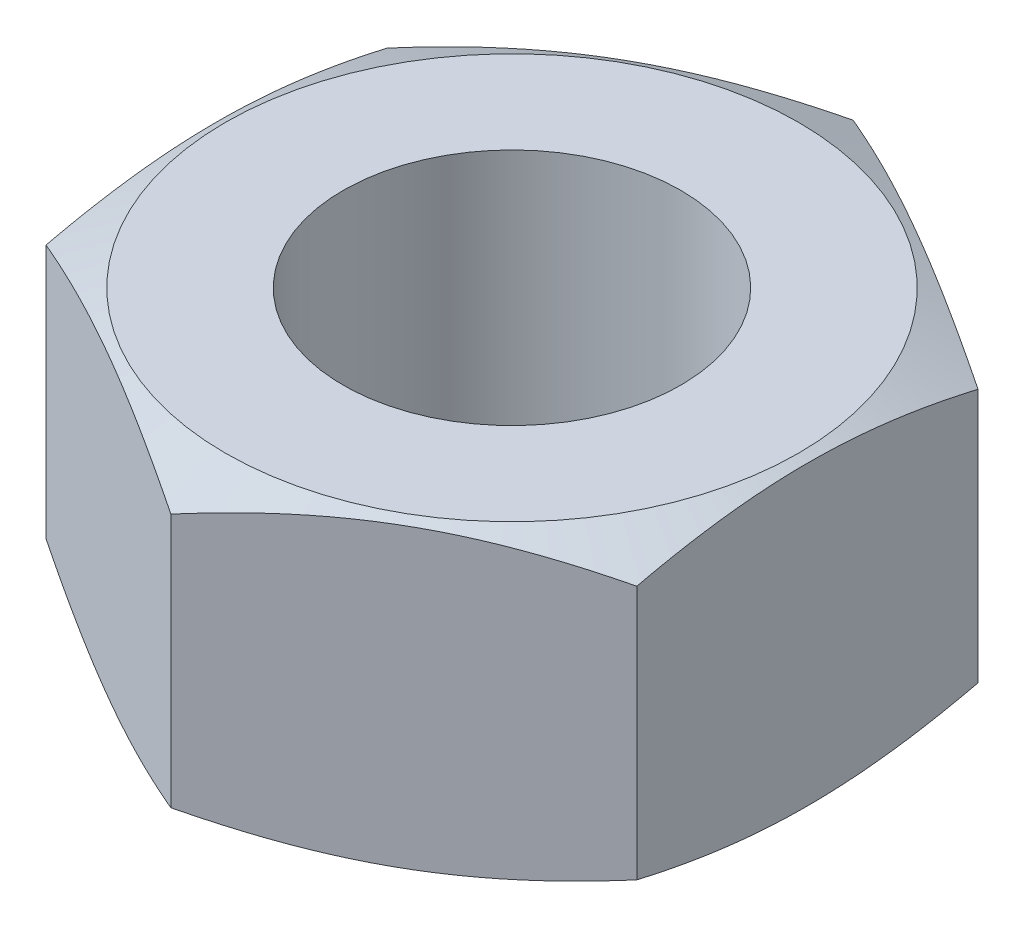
ISO-10303-21;
HEADER;
FILE_DESCRIPTION(('STEP AP214'),'2;1');
FILE_NAME('part.step','',(''),(''),'','','');
FILE_SCHEMA(('AUTOMOTIVE_DESIGN { 1 0 10303 214 1 1 1 1 }'));
ENDSEC;
DATA;
#1=APPLICATION_CONTEXT('core data for automotive mechanical design processes');
#2=APPLICATION_PROTOCOL_DEFINITION('international standard','automotive_design',2000,#1);
#3=PRODUCT_CONTEXT('',#1,'mechanical');
#4=PRODUCT('Part','Part','',(#3));
#5=PRODUCT_RELATED_PRODUCT_CATEGORY('part','',(#4));
#6=PRODUCT_DEFINITION_FORMATION('','',#4);
#7=PRODUCT_DEFINITION_CONTEXT('part definition',#1,'design');
#8=PRODUCT_DEFINITION('design','',#6,#7);
#9=PRODUCT_DEFINITION_SHAPE('','',#8);
#10=(LENGTH_UNIT() NAMED_UNIT(*) SI_UNIT(.MILLI.,.METRE.));
#11=(NAMED_UNIT(*) PLANE_ANGLE_UNIT() SI_UNIT($,.RADIAN.));
#12=(NAMED_UNIT(*) SI_UNIT($,.STERADIAN.) SOLID_ANGLE_UNIT());
#13=UNCERTAINTY_MEASURE_WITH_UNIT(LENGTH_MEASURE(1.E-05),#10,'distance_accuracy_value','');
#14=(GEOMETRIC_REPRESENTATION_CONTEXT(3) GLOBAL_UNCERTAINTY_ASSIGNED_CONTEXT((#13)) GLOBAL_UNIT_ASSIGNED_CONTEXT((#10,
#11,#12)) REPRESENTATION_CONTEXT('',''));
#15=CARTESIAN_POINT('',(0.,0.,0.));
#16=DIRECTION('',(0.,0.,1.));
#17=DIRECTION('',(1.,0.,0.));
#18=AXIS2_PLACEMENT_3D('',#15,#16,#17);
#19=CARTESIAN_POINT('',(5.38927608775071,0.,1.94289029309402E-13));
#20=DIRECTION('',(0.,-1.,0.));
#21=DIRECTION('',(0.,0.,-1.));
#22=AXIS2_PLACEMENT_3D('',#19,#20,#21);
#23=PLANE('',#22);
#24=CARTESIAN_POINT('',(1.52655665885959E-13,0.,0.));
#25=DIRECTION('',(0.,-1.,0.));
#26=DIRECTION('',(0.,0.,-1.));
#27=AXIS2_PLACEMENT_3D('',#24,#25,#26);
#28=CIRCLE('',#27,5.38927608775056);
#29=CARTESIAN_POINT('',(1.53403578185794E-13,0.,-5.38927608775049));
#30=VERTEX_POINT('',#29);
#31=EDGE_CURVE('E189',#30,#30,#28,.T.);
#32=ORIENTED_EDGE('',*,*,#31,.T.);
#33=EDGE_LOOP('',(#32));
#34=FACE_BOUND('',#33,.T.);
#35=CARTESIAN_POINT('',(1.52655665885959E-13,0.,0.));
#36=DIRECTION('',(0.,-1.,0.));
#37=DIRECTION('',(0.,0.,-1.));
#38=AXIS2_PLACEMENT_3D('',#35,#36,#37);
#39=CIRCLE('',#38,3.175);
#40=CARTESIAN_POINT('',(1.53096285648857E-13,0.,-3.17499999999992));
#41=VERTEX_POINT('',#40);
#42=EDGE_CURVE('E197',#41,#41,#39,.T.);
#43=ORIENTED_EDGE('',*,*,#42,.F.);
#44=EDGE_LOOP('',(#43));
#45=FACE_BOUND('',#44,.T.);
#46=ADVANCED_FACE('F31',(#34,#45),#23,.T.);
#47=CARTESIAN_POINT('',(0.,-57.404,0.));
#48=DIRECTION('',(0.,-1.,0.));
#49=DIRECTION('',(0.,0.,-1.));
#50=AXIS2_PLACEMENT_3D('',#47,#48,#49);
#51=CYLINDRICAL_SURFACE('',#50,3.175);
#52=ORIENTED_EDGE('',*,*,#42,.T.);
#53=EDGE_LOOP('',(#52));
#54=FACE_BOUND('',#53,.T.);
#55=CARTESIAN_POINT('',(1.38777878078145E-13,5.74039999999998,0.));
#56=DIRECTION('',(0.,-1.,0.));
#57=DIRECTION('',(0.,0.,-1.));
#58=AXIS2_PLACEMENT_3D('',#55,#56,#57);
#59=CIRCLE('',#58,3.175);
#60=CARTESIAN_POINT('',(1.39218497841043E-13,5.74039999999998,-3.17499999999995));
#61=VERTEX_POINT('',#60);
#62=EDGE_CURVE('E195',#61,#61,#59,.T.);
#63=ORIENTED_EDGE('',*,*,#62,.F.);
#64=EDGE_LOOP('',(#63));
#65=FACE_BOUND('',#64,.T.);
#66=ADVANCED_FACE('F227',(#54,#65),#51,.F.);
#67=CARTESIAN_POINT('',(3.17500000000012,5.74040000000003,1.11022302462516E-13));
#68=DIRECTION('',(0.,1.,0.));
#69=DIRECTION('',(0.,0.,1.));
#70=AXIS2_PLACEMENT_3D('',#67,#68,#69);
#71=PLANE('',#70);
#72=ORIENTED_EDGE('',*,*,#62,.T.);
#73=EDGE_LOOP('',(#72));
#74=FACE_BOUND('',#73,.T.);
#75=CARTESIAN_POINT('',(1.38777878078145E-13,5.74039999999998,0.));
#76=DIRECTION('',(0.,-1.,0.));
#77=DIRECTION('',(0.,0.,-1.));
#78=AXIS2_PLACEMENT_3D('',#75,#76,#77);
#79=CIRCLE('',#78,5.38927608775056);
#80=CARTESIAN_POINT('',(1.3952579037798E-13,5.74039999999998,-5.38927608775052));
#81=VERTEX_POINT('',#80);
#82=EDGE_CURVE('E192',#81,#81,#79,.T.);
#83=ORIENTED_EDGE('',*,*,#82,.F.);
#84=EDGE_LOOP('',(#83));
#85=FACE_BOUND('',#84,.T.);
#86=ADVANCED_FACE('F232',(#74,#85),#71,.T.);
#87=CARTESIAN_POINT('',(1.66533453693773E-13,5.26172176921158,0.));
#88=DIRECTION('',(0.,-1.,0.));
#89=DIRECTION('',(0.,0.,-1.));
#90=AXIS2_PLACEMENT_3D('',#87,#88,#89);
#91=CONICAL_SURFACE('',#90,6.41580486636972,1.13446401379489);
#92=CARTESIAN_POINT('',(5.55624999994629,3.52024736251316,-8.49463856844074));
#93=CARTESIAN_POINT('',(5.55624999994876,3.6176310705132,-8.24501883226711));
#94=CARTESIAN_POINT('',(5.55624999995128,3.71394822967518,-7.99497513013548));
#95=CARTESIAN_POINT('',(5.55624999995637,3.9038444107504,-7.49381496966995));
#96=CARTESIAN_POINT('',(5.55624999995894,3.99742308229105,-7.24269837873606));
#97=CARTESIAN_POINT('',(5.55624999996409,4.18152451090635,-6.73837536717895));
#98=CARTESIAN_POINT('',(5.55624999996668,4.27203579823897,-6.48516474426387));
#99=CARTESIAN_POINT('',(5.55624999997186,4.44880608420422,-5.97726759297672));
#100=CARTESIAN_POINT('',(5.55624999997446,4.53506523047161,-5.72258111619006));
#101=CARTESIAN_POINT('',(5.55624999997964,4.70111389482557,-5.21486442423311));
#102=CARTESIAN_POINT('',(5.55624999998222,4.78097447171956,-4.96185756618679));
#103=CARTESIAN_POINT('',(5.55624999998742,4.93411769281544,-4.45383176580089));
#104=CARTESIAN_POINT('',(5.55624999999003,5.00739999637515,-4.19881272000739));
#105=CARTESIAN_POINT('',(5.55624999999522,5.14557728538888,-3.68676419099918));
#106=CARTESIAN_POINT('',(5.55624999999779,5.21048048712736,-3.42973694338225));
#107=CARTESIAN_POINT('',(5.55625000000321,5.32986380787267,-2.91326970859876));
#108=CARTESIAN_POINT('',(5.55625000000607,5.38434538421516,-2.65383006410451));
#109=CARTESIAN_POINT('',(5.55625000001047,5.46525328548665,-2.21521628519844));
#110=CARTESIAN_POINT('',(5.55625000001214,5.49509801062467,-2.03667290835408));
#111=CARTESIAN_POINT('',(5.55625000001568,5.54804139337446,-1.67859373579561));
#112=CARTESIAN_POINT('',(5.55625000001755,5.57114065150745,-1.49905802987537));
#113=CARTESIAN_POINT('',(5.55625000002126,5.60989472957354,-1.13925767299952));
#114=CARTESIAN_POINT('',(5.55625000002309,5.62555284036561,-0.958993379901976));
#115=CARTESIAN_POINT('',(5.55625000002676,5.64891218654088,-0.597945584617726));
#116=CARTESIAN_POINT('',(5.55625000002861,5.65661348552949,-0.417162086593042));
#117=CARTESIAN_POINT('',(5.55625000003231,5.66379554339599,-0.054654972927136));
#118=CARTESIAN_POINT('',(5.55625000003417,5.66324095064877,0.127069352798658));
#119=CARTESIAN_POINT('',(5.55625000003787,5.65384581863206,0.49030300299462));
#120=CARTESIAN_POINT('',(5.55625000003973,5.64500516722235,0.67181232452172));
#121=CARTESIAN_POINT('',(5.55625000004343,5.61935596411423,1.03429451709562));
#122=CARTESIAN_POINT('',(5.55625000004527,5.60254603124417,1.21526728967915));
#123=CARTESIAN_POINT('',(5.55625000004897,5.56152364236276,1.57634958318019));
#124=CARTESIAN_POINT('',(5.55625000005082,5.53731141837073,1.75645913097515));
#125=CARTESIAN_POINT('',(5.55625000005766,5.435053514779,2.42292101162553));
#126=CARTESIAN_POINT('',(5.55625000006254,5.33577127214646,2.90607980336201));
#127=CARTESIAN_POINT('',(5.55625000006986,5.16149115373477,3.62447986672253));
#128=CARTESIAN_POINT('',(5.5562500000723,5.09912318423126,3.86304216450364));
#129=CARTESIAN_POINT('',(5.55625000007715,4.9675289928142,4.33827745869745));
#130=CARTESIAN_POINT('',(5.55625000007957,4.89830320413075,4.57495057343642));
#131=CARTESIAN_POINT('',(5.55625000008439,4.75394379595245,5.04790289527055));
#132=CARTESIAN_POINT('',(5.5562500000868,4.67877953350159,5.28417263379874));
#133=CARTESIAN_POINT('',(5.55625000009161,4.52396800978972,5.75523792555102));
#134=CARTESIAN_POINT('',(5.55625000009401,4.44432070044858,5.99003346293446));
#135=CARTESIAN_POINT('',(5.55625000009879,4.28144690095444,6.45824257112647));
#136=CARTESIAN_POINT('',(5.55625000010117,4.19822223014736,6.69165677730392));
#137=CARTESIAN_POINT('',(5.55625000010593,4.02882364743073,7.15741439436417));
#138=CARTESIAN_POINT('',(5.5562500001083,3.94264968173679,7.38975778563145));
#139=CARTESIAN_POINT('',(5.55625000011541,3.6798991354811,8.08710182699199));
#140=CARTESIAN_POINT('',(5.55625000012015,3.4996888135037,8.55073245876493));
#141=CARTESIAN_POINT('',(5.55625000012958,3.1326303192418,9.4754095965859));
#142=CARTESIAN_POINT('',(5.55625000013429,2.94578127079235,9.93645575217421));
#143=CARTESIAN_POINT('',(5.55625000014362,2.56978140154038,10.8507160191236));
#144=CARTESIAN_POINT('',(5.55625000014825,2.38069061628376,11.3039548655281));
#145=CARTESIAN_POINT('',(5.55625000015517,2.09453577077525,11.9826893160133));
#146=CARTESIAN_POINT('',(5.55625000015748,1.99874163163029,12.2087222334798));
#147=CARTESIAN_POINT('',(5.5562500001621,1.80641398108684,12.6604717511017));
#148=CARTESIAN_POINT('',(5.55625000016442,1.7098804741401,12.886188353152));
#149=CARTESIAN_POINT('',(5.55625000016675,1.613030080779,13.1117689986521));
#150=B_SPLINE_CURVE_WITH_KNOTS('',3,(#92,#93,#94,#95,#96,#97,#98,#99,#100,#101,#102,#103,#104,
#105,#106,#107,#108,#109,#110,#111,#112,#113,#114,#115,#116,#117,#118,#119,#120,#121,#122,#123,
#124,#125,#126,#127,#128,#129,#130,#131,#132,#133,#134,#135,#136,#137,#138,#139,#140,#141,#142,
#143,#144,#145,#146,#147,#148,#149),.UNSPECIFIED.,.F.,.F.,(4,2,2,2,2,2,2,2,2,2,2,2,2,2,2,2,2,2,
2,2,2,2,2,2,2,2,2,2,4),(0.,0.803838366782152,1.60777913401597,2.41445283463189,3.22109850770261,
4.01696333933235,4.81286935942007,5.60798891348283,6.40299719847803,6.94594921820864,
7.48885288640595,8.03151623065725,8.57417523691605,9.11915856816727,9.66414927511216,
10.209234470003,10.7543025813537,12.2318072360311,12.9715152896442,13.7111766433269,
14.4549412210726,15.198713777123,15.9421124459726,16.6855246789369,18.1777055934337,
19.6700841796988,21.1433688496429,21.8798505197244,22.6163277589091),.UNSPECIFIED.);
#151=CARTESIAN_POINT('',(5.55625000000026,5.26172176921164,-3.2079024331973));
#152=VERTEX_POINT('',#151);
#153=CARTESIAN_POINT('',(5.55625000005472,5.26172176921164,3.20790243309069));
#154=VERTEX_POINT('',#153);
#155=EDGE_CURVE('E181',#152,#154,#150,.T.);
#156=ORIENTED_EDGE('',*,*,#155,.F.);
#157=CARTESIAN_POINT('',(-0.000200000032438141,5.26166792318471,-6.41592033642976));
#158=CARTESIAN_POINT('',(0.167832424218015,5.30690640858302,-6.31890677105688));
#159=CARTESIAN_POINT('',(0.336484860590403,5.34923979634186,-6.22153524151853));
#160=CARTESIAN_POINT('',(0.675055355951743,5.42708797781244,-6.02606147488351));
#161=CARTESIAN_POINT('',(0.844974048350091,5.46259908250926,-5.92795887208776));
#162=CARTESIAN_POINT('',(1.18608097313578,5.52577286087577,-5.73102069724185));
#163=CARTESIAN_POINT('',(1.35727024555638,5.55342815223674,-5.63218452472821));
#164=CARTESIAN_POINT('',(1.70052644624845,5.59986946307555,-5.43400546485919));
#165=CARTESIAN_POINT('',(1.87259320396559,5.61865714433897,-5.33466267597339));
#166=CARTESIAN_POINT('',(2.21374464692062,5.6463253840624,-5.13769879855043));
#167=CARTESIAN_POINT('',(2.38281718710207,5.65540328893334,-5.04008472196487));
#168=CARTESIAN_POINT('',(2.72115728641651,5.66395507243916,-4.84474397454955));
#169=CARTESIAN_POINT('',(2.89042485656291,5.66342837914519,-4.74701729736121));
#170=CARTESIAN_POINT('',(3.22857252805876,5.65279751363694,-4.55178764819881));
#171=CARTESIAN_POINT('',(3.39745284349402,5.64270226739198,-4.45428455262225));
#172=CARTESIAN_POINT('',(3.73459638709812,5.61336894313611,-4.25963463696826));
#173=CARTESIAN_POINT('',(3.9028596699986,5.59413169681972,-4.16248778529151));
#174=CARTESIAN_POINT('',(4.19513967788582,5.55330735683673,-3.99373984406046));
#175=CARTESIAN_POINT('',(4.31935897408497,5.53361070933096,-3.92202179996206));
#176=CARTESIAN_POINT('',(4.56722968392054,5.48996361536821,-3.7789135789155));
#177=CARTESIAN_POINT('',(4.69088112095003,5.46601334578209,-3.70752338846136));
#178=CARTESIAN_POINT('',(4.93857150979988,5.41404172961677,-3.56451927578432));
#179=CARTESIAN_POINT('',(5.06260547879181,5.38598895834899,-3.49290823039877));
#180=CARTESIAN_POINT('',(5.31001754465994,5.3263662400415,-3.35006480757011));
#181=CARTESIAN_POINT('',(5.43339574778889,5.29479688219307,-3.27883236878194));
#182=CARTESIAN_POINT('',(5.55645000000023,5.26166792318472,-3.20778696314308));
#183=B_SPLINE_CURVE_WITH_KNOTS('',3,(#157,#158,#159,#160,#161,#162,#163,#164,#165,#166,#167,
#168,#169,#170,#171,#172,#173,#174,#175,#176,#177,#178,#179,#180,#181,#182),.UNSPECIFIED.,.F.,
.F.,(4,2,2,2,2,2,2,2,2,2,2,2,4),(0.,0.597727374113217,1.19577705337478,1.7943868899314,
2.39288450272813,2.97897228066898,3.56509495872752,4.15067141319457,4.73619460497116,
5.17047749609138,5.60474233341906,6.04252711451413,6.48023865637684),.UNSPECIFIED.);
#184=CARTESIAN_POINT('',(-3.25156568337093E-11,5.26172176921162,-6.41580486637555));
#185=VERTEX_POINT('',#184);
#186=EDGE_CURVE('E176',#185,#152,#183,.T.);
#187=ORIENTED_EDGE('',*,*,#186,.F.);
#188=CARTESIAN_POINT('',(-5.55645000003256,5.26166792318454,-3.20778696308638));
#189=CARTESIAN_POINT('',(-5.3884175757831,5.306906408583,-3.30480052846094));
#190=CARTESIAN_POINT('',(-5.21976513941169,5.3492397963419,-3.402172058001));
#191=CARTESIAN_POINT('',(-4.88119464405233,5.42708797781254,-3.59764582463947));
#192=CARTESIAN_POINT('',(-4.71127595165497,5.46259908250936,-3.69574842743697));
#193=CARTESIAN_POINT('',(-4.3701690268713,5.52577286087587,-3.89268660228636));
#194=CARTESIAN_POINT('',(-4.19897975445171,5.55342815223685,-3.99152277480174));
#195=CARTESIAN_POINT('',(-3.85572355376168,5.59986946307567,-4.18970183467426));
#196=CARTESIAN_POINT('',(-3.68365679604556,5.61865714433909,-4.28904462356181));
#197=CARTESIAN_POINT('',(-3.34250535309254,5.64632538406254,-4.48600850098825));
#198=CARTESIAN_POINT('',(-3.17343281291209,5.65540328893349,-4.58362257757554));
#199=CARTESIAN_POINT('',(-2.83509271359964,5.66395507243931,-4.77896332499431));
#200=CARTESIAN_POINT('',(-2.66582514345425,5.66342837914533,-4.87669000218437));
#201=CARTESIAN_POINT('',(-2.32767747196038,5.65279751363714,-5.07191965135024));
#202=CARTESIAN_POINT('',(-2.15879715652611,5.64270226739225,-5.16942274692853));
#203=CARTESIAN_POINT('',(-1.82165361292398,5.61336894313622,-5.36407266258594));
#204=CARTESIAN_POINT('',(-1.65339033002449,5.5941316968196,-5.46121951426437));
#205=CARTESIAN_POINT('',(-1.36111032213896,5.55330735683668,-5.62996745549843));
#206=CARTESIAN_POINT('',(-1.23689102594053,5.53361070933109,-5.70168549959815));
#207=CARTESIAN_POINT('',(-0.989020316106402,5.48996361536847,-5.84479372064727));
#208=CARTESIAN_POINT('',(-0.865368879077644,5.46601334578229,-5.91618391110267));
#209=CARTESIAN_POINT('',(-0.617678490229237,5.41404172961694,-6.05918802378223));
#210=CARTESIAN_POINT('',(-0.49364452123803,5.38598895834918,-6.13079906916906));
#211=CARTESIAN_POINT('',(-0.246232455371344,5.32636624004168,-6.27364249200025));
#212=CARTESIAN_POINT('',(-0.122854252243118,5.2947968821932,-6.34487493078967));
#213=CARTESIAN_POINT('',(0.000199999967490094,5.26166792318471,-6.41592033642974));
#214=B_SPLINE_CURVE_WITH_KNOTS('',3,(#188,#189,#190,#191,#192,#193,#194,#195,#196,#197,#198,
#199,#200,#201,#202,#203,#204,#205,#206,#207,#208,#209,#210,#211,#212,#213),.UNSPECIFIED.,.F.,
.F.,(4,2,2,2,2,2,2,2,2,2,2,2,4),(0.,0.597727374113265,1.19577705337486,1.79438688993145,
2.39288450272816,2.97897228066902,3.56509495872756,4.15067141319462,4.73619460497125,
5.17047749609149,5.60474233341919,6.04252711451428,6.48023865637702),.UNSPECIFIED.);
#215=CARTESIAN_POINT('',(-5.55625000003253,5.26172176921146,-3.20790243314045));
#216=VERTEX_POINT('',#215);
#217=EDGE_CURVE('E107',#216,#185,#214,.T.);
#218=ORIENTED_EDGE('',*,*,#217,.F.);
#219=CARTESIAN_POINT('',(-5.55625000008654,3.52024736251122,-8.49463856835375));
#220=CARTESIAN_POINT('',(-5.55625000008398,3.61763107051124,-8.2450188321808));
#221=CARTESIAN_POINT('',(-5.55625000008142,3.71394822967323,-7.99497513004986));
#222=CARTESIAN_POINT('',(-5.5562500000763,3.90384441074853,-7.49381496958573));
#223=CARTESIAN_POINT('',(-5.55625000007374,3.99742308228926,-7.24269837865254));
#224=CARTESIAN_POINT('',(-5.55625000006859,4.18152451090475,-6.73837536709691));
#225=CARTESIAN_POINT('',(-5.55625000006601,4.2720357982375,-6.48516474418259));
#226=CARTESIAN_POINT('',(-5.55625000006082,4.44880608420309,-5.977267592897));
#227=CARTESIAN_POINT('',(-5.55625000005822,4.53506523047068,-5.72258111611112));
#228=CARTESIAN_POINT('',(-5.55625000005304,4.70111389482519,-5.21486442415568));
#229=CARTESIAN_POINT('',(-5.55625000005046,4.78097447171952,-4.96185756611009));
#230=CARTESIAN_POINT('',(-5.55625000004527,4.93411769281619,-4.45383176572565));
#231=CARTESIAN_POINT('',(-5.55625000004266,5.00739999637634,-4.19881271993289));
#232=CARTESIAN_POINT('',(-5.55625000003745,5.14557728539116,-3.68676419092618));
#233=CARTESIAN_POINT('',(-5.55625000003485,5.21048048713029,-3.42973694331));
#234=CARTESIAN_POINT('',(-5.55625000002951,5.32986380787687,-2.91326970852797));
#235=CARTESIAN_POINT('',(-5.55625000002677,5.38434538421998,-2.65383006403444));
#236=CARTESIAN_POINT('',(-5.55625000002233,5.46525328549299,-2.21521628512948));
#237=CARTESIAN_POINT('',(-5.55625000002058,5.49509801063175,-2.0366729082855));
#238=CARTESIAN_POINT('',(-5.55625000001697,5.54804139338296,-1.67859373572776));
#239=CARTESIAN_POINT('',(-5.55625000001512,5.57114065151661,-1.49905802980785));
#240=CARTESIAN_POINT('',(-5.55625000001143,5.60989472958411,-1.13925767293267));
#241=CARTESIAN_POINT('',(-5.5562500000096,5.62555284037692,-0.958993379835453));
#242=CARTESIAN_POINT('',(-5.55625000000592,5.64891218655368,-0.59794558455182));
#243=CARTESIAN_POINT('',(-5.55625000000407,5.65661348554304,-0.417162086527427));
#244=CARTESIAN_POINT('',(-5.55625000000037,5.66379554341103,-0.0546549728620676));
#245=CARTESIAN_POINT('',(-5.55624999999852,5.66324095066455,0.12706935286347));
#246=CARTESIAN_POINT('',(-5.55624999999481,5.65384581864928,0.490303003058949));
#247=CARTESIAN_POINT('',(-5.55624999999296,5.64500516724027,0.671812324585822));
#248=CARTESIAN_POINT('',(-5.55624999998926,5.61935596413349,1.03429451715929));
#249=CARTESIAN_POINT('',(-5.55624999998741,5.60254603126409,1.21526728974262));
#250=CARTESIAN_POINT('',(-5.55624999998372,5.56152364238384,1.57634958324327));
#251=CARTESIAN_POINT('',(-5.55624999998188,5.53731141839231,1.75645913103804));
#252=CARTESIAN_POINT('',(-5.55624999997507,5.43505351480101,2.42292101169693));
#253=CARTESIAN_POINT('',(-5.55624999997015,5.33577127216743,2.90607980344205));
#254=CARTESIAN_POINT('',(-5.55624999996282,5.16149115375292,3.62447986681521));
#255=CARTESIAN_POINT('',(-5.55624999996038,5.09912318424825,3.8630421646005));
#256=CARTESIAN_POINT('',(-5.55624999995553,4.96752899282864,4.3382774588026));
#257=CARTESIAN_POINT('',(-5.55624999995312,4.8983032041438,4.57495057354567));
#258=CARTESIAN_POINT('',(-5.55624999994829,4.7539437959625,5.04790289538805));
#259=CARTESIAN_POINT('',(-5.55624999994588,4.67877953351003,5.28417263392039));
#260=CARTESIAN_POINT('',(-5.55624999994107,4.52396800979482,5.75523792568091));
#261=CARTESIAN_POINT('',(-5.55624999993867,4.44432070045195,5.99003346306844));
#262=CARTESIAN_POINT('',(-5.5562499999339,4.28144690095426,6.4582425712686));
#263=CARTESIAN_POINT('',(-5.55624999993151,4.19822223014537,6.6916567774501));
#264=CARTESIAN_POINT('',(-5.55624999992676,4.02882364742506,7.15741439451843));
#265=CARTESIAN_POINT('',(-5.55624999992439,3.94264968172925,7.38975778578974));
#266=CARTESIAN_POINT('',(-5.55624999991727,3.67989913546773,8.08710182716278));
#267=CARTESIAN_POINT('',(-5.55624999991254,3.4996888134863,8.55073245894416));
#268=CARTESIAN_POINT('',(-5.5562499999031,3.13263031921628,9.475409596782));
#269=CARTESIAN_POINT('',(-5.5562499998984,2.94578127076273,9.93645575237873));
#270=CARTESIAN_POINT('',(-5.55624999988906,2.56978140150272,10.8507160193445));
#271=CARTESIAN_POINT('',(-5.55624999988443,2.38069061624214,11.303954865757));
#272=CARTESIAN_POINT('',(-5.55624999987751,2.09453577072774,11.9826893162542));
#273=CARTESIAN_POINT('',(-5.5562499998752,1.99874163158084,12.2087222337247));
#274=CARTESIAN_POINT('',(-5.55624999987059,1.80641398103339,12.6604717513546));
#275=CARTESIAN_POINT('',(-5.55624999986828,1.70988047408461,12.8861883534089));
#276=CARTESIAN_POINT('',(-5.55624999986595,1.61303008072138,13.1117689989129));
#277=B_SPLINE_CURVE_WITH_KNOTS('',3,(#219,#220,#221,#222,#223,#224,#225,#226,#227,#228,#229,
#230,#231,#232,#233,#234,#235,#236,#237,#238,#239,#240,#241,#242,#243,#244,#245,#246,#247,#248,
#249,#250,#251,#252,#253,#254,#255,#256,#257,#258,#259,#260,#261,#262,#263,#264,#265,#266,#267,
#268,#269,#270,#271,#272,#273,#274,#275,#276),.UNSPECIFIED.,.F.,.F.,(4,2,2,2,2,2,2,2,2,2,2,2,2,
2,2,2,2,2,2,2,2,2,2,2,2,2,2,2,4),(0.,0.803838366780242,1.60777913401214,2.41445283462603,
3.22109850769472,4.01696333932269,4.81286935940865,5.6079889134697,6.4029971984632,
6.94594921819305,7.4888528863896,8.03151623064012,8.57417523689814,9.11915856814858,
9.66414927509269,10.2092344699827,10.7543025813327,12.2318072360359,12.971515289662,
13.7111766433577,14.4549412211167,15.1987137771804,15.9421124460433,16.6855246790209,
18.1777055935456,19.6700841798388,21.1433688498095,21.8798505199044,22.6163277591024),.UNSPECIFIED.);
#278=CARTESIAN_POINT('',(-5.55624999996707,5.26172176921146,3.20790243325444));
#279=VERTEX_POINT('',#278);
#280=EDGE_CURVE('E105',#279,#216,#277,.F.);
#281=ORIENTED_EDGE('',*,*,#280,.F.);
#282=CARTESIAN_POINT('',(0.000200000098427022,5.26166792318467,6.41592033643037));
#283=CARTESIAN_POINT('',(-0.167832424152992,5.30690640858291,6.31890677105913));
#284=CARTESIAN_POINT('',(-0.336484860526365,5.34923979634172,6.22153524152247));
#285=CARTESIAN_POINT('',(-0.675055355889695,5.42708797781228,6.02606147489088));
#286=CARTESIAN_POINT('',(-0.844974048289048,5.46259908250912,5.92795887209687));
#287=CARTESIAN_POINT('',(-1.18608097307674,5.52577286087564,5.73102069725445));
#288=CARTESIAN_POINT('',(-1.35727024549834,5.55342815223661,5.63218452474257));
#289=CARTESIAN_POINT('',(-1.70052644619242,5.59986946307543,5.43400546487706));
#290=CARTESIAN_POINT('',(-1.87259320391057,5.61865714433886,5.33466267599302));
#291=CARTESIAN_POINT('',(-2.2137446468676,5.6463253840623,5.13769879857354));
#292=CARTESIAN_POINT('',(-2.38281718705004,5.65540328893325,5.0400847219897));
#293=CARTESIAN_POINT('',(-2.72115728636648,5.66395507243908,4.84474397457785));
#294=CARTESIAN_POINT('',(-2.89042485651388,5.6634283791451,4.74701729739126));
#295=CARTESIAN_POINT('',(-3.2285725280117,5.65279751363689,4.55178764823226));
#296=CARTESIAN_POINT('',(-3.39745284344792,5.64270226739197,4.45428455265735));
#297=CARTESIAN_POINT('',(-3.73459638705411,5.61336894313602,4.25963463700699));
#298=CARTESIAN_POINT('',(-3.90285966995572,5.59413169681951,4.16248778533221));
#299=CARTESIAN_POINT('',(-4.19513967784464,5.55330735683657,3.99373984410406));
#300=CARTESIAN_POINT('',(-4.31935897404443,5.5336107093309,3.92202180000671));
#301=CARTESIAN_POINT('',(-4.56722968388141,5.48996361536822,3.77891357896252));
#302=CARTESIAN_POINT('',(-4.69088112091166,5.46601334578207,3.70752338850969));
#303=CARTESIAN_POINT('',(-4.93857150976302,5.41404172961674,3.5645192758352));
#304=CARTESIAN_POINT('',(-5.06260547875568,5.38598895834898,3.49290823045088));
#305=CARTESIAN_POINT('',(-5.31001754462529,5.32636624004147,3.35006480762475));
#306=CARTESIAN_POINT('',(-5.433395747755,5.294796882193,3.27883236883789));
#307=CARTESIAN_POINT('',(-5.55644999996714,5.26166792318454,3.20778696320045));
#308=B_SPLINE_CURVE_WITH_KNOTS('',3,(#282,#283,#284,#285,#286,#287,#288,#289,#290,#291,#292,
#293,#294,#295,#296,#297,#298,#299,#300,#301,#302,#303,#304,#305,#306,#307),.UNSPECIFIED.,.F.,
.F.,(4,2,2,2,2,2,2,2,2,2,2,2,4),(0.,0.597727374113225,1.19577705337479,1.79438688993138,
2.3928845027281,2.97897228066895,3.56509495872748,4.15067141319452,4.73619460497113,
5.17047749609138,5.6047423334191,6.04252711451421,6.48023865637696),.UNSPECIFIED.);
#309=CARTESIAN_POINT('',(9.8504537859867E-11,5.26172176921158,6.41580486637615));
#310=VERTEX_POINT('',#309);
#311=EDGE_CURVE('E89',#310,#279,#308,.T.);
#312=ORIENTED_EDGE('',*,*,#311,.F.);
#313=CARTESIAN_POINT('',(5.55645000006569,5.26166792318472,3.20778696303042));
#314=CARTESIAN_POINT('',(5.38841757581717,5.30690640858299,3.30480052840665));
#315=CARTESIAN_POINT('',(5.21976513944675,5.3492397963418,3.4021720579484));
#316=CARTESIAN_POINT('',(4.88119464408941,5.42708797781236,3.5976458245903));
#317=CARTESIAN_POINT('',(4.71127595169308,5.4625990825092,3.69574842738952));
#318=CARTESIAN_POINT('',(4.37016902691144,5.5257728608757,3.89268660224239));
#319=CARTESIAN_POINT('',(4.19897975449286,5.55342815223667,3.99152277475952));
#320=CARTESIAN_POINT('',(3.85572355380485,5.59986946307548,4.18970183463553));
#321=CARTESIAN_POINT('',(3.68365679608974,5.61865714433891,4.28904462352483));
#322=CARTESIAN_POINT('',(3.34250535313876,5.64632538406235,4.48600850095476));
#323=CARTESIAN_POINT('',(3.17343281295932,5.65540328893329,4.58362257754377));
#324=CARTESIAN_POINT('',(2.83509271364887,5.66395507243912,4.77896332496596));
#325=CARTESIAN_POINT('',(2.66582514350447,5.66342837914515,4.87669000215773));
#326=CARTESIAN_POINT('',(2.32767747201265,5.65279751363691,5.07191965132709));
#327=CARTESIAN_POINT('',(2.15879715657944,5.64270226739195,5.16942274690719));
#328=CARTESIAN_POINT('',(1.82165361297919,5.6133689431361,5.36407266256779));
#329=CARTESIAN_POINT('',(1.65339033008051,5.59413169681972,5.46121951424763));
#330=CARTESIAN_POINT('',(1.36111032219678,5.55330735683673,5.62996745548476));
#331=CARTESIAN_POINT('',(1.23689102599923,5.53361070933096,5.70168549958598));
#332=CARTESIAN_POINT('',(0.989020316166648,5.4899636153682,5.84479372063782));
#333=CARTESIAN_POINT('',(0.865368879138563,5.46601334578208,5.91618391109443));
#334=CARTESIAN_POINT('',(0.617678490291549,5.41404172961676,6.05918802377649));
#335=CARTESIAN_POINT('',(0.493644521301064,5.38598895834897,6.13079906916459));
#336=CARTESIAN_POINT('',(0.246232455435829,5.32636624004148,6.27364249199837));
#337=CARTESIAN_POINT('',(0.12285425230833,5.29479688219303,6.34487493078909));
#338=CARTESIAN_POINT('',(-0.000199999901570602,5.26166792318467,6.41592033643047));
#339=B_SPLINE_CURVE_WITH_KNOTS('',3,(#313,#314,#315,#316,#317,#318,#319,#320,#321,#322,#323,
#324,#325,#326,#327,#328,#329,#330,#331,#332,#333,#334,#335,#336,#337,#338),.UNSPECIFIED.,.F.,
.F.,(4,2,2,2,2,2,2,2,2,2,2,2,4),(0.,0.59772737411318,1.19577705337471,1.79438688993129,
2.392884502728,2.97897228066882,3.56509495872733,4.15067141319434,4.7361946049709,
5.17047749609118,5.60474233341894,6.04252711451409,6.48023865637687),.UNSPECIFIED.);
#340=EDGE_CURVE('E84',#154,#310,#339,.T.);
#341=ORIENTED_EDGE('',*,*,#340,.F.);
#342=EDGE_LOOP('',(#156,#187,#218,#281,#312,#341));
#343=FACE_BOUND('',#342,.T.);
#344=ORIENTED_EDGE('',*,*,#82,.T.);
#345=EDGE_LOOP('',(#344));
#346=FACE_BOUND('',#345,.T.);
#347=ADVANCED_FACE('F102',(#343,#346),#91,.T.);
#348=CARTESIAN_POINT('',(1.52655665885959E-13,0.,0.));
#349=DIRECTION('',(0.,1.,0.));
#350=DIRECTION('',(0.,0.,1.));
#351=AXIS2_PLACEMENT_3D('',#348,#349,#350);
#352=CONICAL_SURFACE('',#351,5.38927608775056,1.1344640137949);
#353=CARTESIAN_POINT('',(5.55624999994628,2.22015263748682,-8.49463856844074));
#354=CARTESIAN_POINT('',(5.55624999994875,2.12276892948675,-8.24501883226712));
#355=CARTESIAN_POINT('',(5.55624999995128,2.02645177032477,-7.99497513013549));
#356=CARTESIAN_POINT('',(5.55624999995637,1.83655558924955,-7.49381496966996));
#357=CARTESIAN_POINT('',(5.55624999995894,1.74297691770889,-7.24269837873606));
#358=CARTESIAN_POINT('',(5.55624999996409,1.5588754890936,-6.73837536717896));
#359=CARTESIAN_POINT('',(5.55624999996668,1.46836420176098,-6.48516474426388));
#360=CARTESIAN_POINT('',(5.55624999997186,1.29159391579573,-5.97726759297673));
#361=CARTESIAN_POINT('',(5.55624999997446,1.20533476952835,-5.72258111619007));
#362=CARTESIAN_POINT('',(5.55624999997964,1.03928610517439,-5.21486442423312));
#363=CARTESIAN_POINT('',(5.55624999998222,0.959425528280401,-4.96185756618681));
#364=CARTESIAN_POINT('',(5.55624999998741,0.806282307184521,-4.45383176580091));
#365=CARTESIAN_POINT('',(5.55624999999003,0.733000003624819,-4.1988127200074));
#366=CARTESIAN_POINT('',(5.55624999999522,0.594822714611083,-3.6867641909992));
#367=CARTESIAN_POINT('',(5.55624999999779,0.529919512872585,-3.42973694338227));
#368=CARTESIAN_POINT('',(5.5562500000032,0.410536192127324,-2.91326970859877));
#369=CARTESIAN_POINT('',(5.55625000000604,0.356054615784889,-2.65383006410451));
#370=CARTESIAN_POINT('',(5.55625000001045,0.275146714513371,-2.21521628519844));
#371=CARTESIAN_POINT('',(5.55625000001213,0.245301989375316,-2.03667290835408));
#372=CARTESIAN_POINT('',(5.55625000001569,0.192358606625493,-1.67859373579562));
#373=CARTESIAN_POINT('',(5.55625000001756,0.169259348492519,-1.49905802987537));
#374=CARTESIAN_POINT('',(5.55625000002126,0.130505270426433,-1.13925767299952));
#375=CARTESIAN_POINT('',(5.55625000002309,0.11484715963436,-0.95899337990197));
#376=CARTESIAN_POINT('',(5.55625000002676,0.091487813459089,-0.597945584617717));
#377=CARTESIAN_POINT('',(5.55625000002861,0.0837865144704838,-0.417162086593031));
#378=CARTESIAN_POINT('',(5.55625000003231,0.076604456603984,-0.054654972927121));
#379=CARTESIAN_POINT('',(5.55625000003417,0.0771590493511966,0.127069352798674));
#380=CARTESIAN_POINT('',(5.55625000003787,0.0865541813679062,0.490303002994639));
#381=CARTESIAN_POINT('',(5.55625000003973,0.0953948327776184,0.67181232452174));
#382=CARTESIAN_POINT('',(5.55625000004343,0.121044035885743,1.03429451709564));
#383=CARTESIAN_POINT('',(5.55625000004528,0.137853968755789,1.21526728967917));
#384=CARTESIAN_POINT('',(5.55625000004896,0.17887635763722,1.57634958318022));
#385=CARTESIAN_POINT('',(5.55625000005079,0.203088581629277,1.75645913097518));
#386=CARTESIAN_POINT('',(5.55625000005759,0.305346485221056,2.42292101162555));
#387=CARTESIAN_POINT('',(5.55625000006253,0.404628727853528,2.90607980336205));
#388=CARTESIAN_POINT('',(5.55625000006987,0.578908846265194,3.62447986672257));
#389=CARTESIAN_POINT('',(5.5562500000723,0.641276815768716,3.86304216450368));
#390=CARTESIAN_POINT('',(5.55625000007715,0.772871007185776,4.3382774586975));
#391=CARTESIAN_POINT('',(5.55625000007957,0.84209679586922,4.57495057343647));
#392=CARTESIAN_POINT('',(5.55625000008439,0.986456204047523,5.0479028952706));
#393=CARTESIAN_POINT('',(5.5562500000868,1.06162046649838,5.28417263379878));
#394=CARTESIAN_POINT('',(5.55625000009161,1.21643199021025,5.75523792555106));
#395=CARTESIAN_POINT('',(5.55625000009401,1.29607929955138,5.9900334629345));
#396=CARTESIAN_POINT('',(5.55625000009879,1.45895309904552,6.45824257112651));
#397=CARTESIAN_POINT('',(5.55625000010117,1.5421777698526,6.69165677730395));
#398=CARTESIAN_POINT('',(5.55625000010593,1.71157635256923,7.15741439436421));
#399=CARTESIAN_POINT('',(5.5562500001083,1.79775031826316,7.38975778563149));
#400=CARTESIAN_POINT('',(5.55625000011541,2.06050086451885,8.08710182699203));
#401=CARTESIAN_POINT('',(5.55625000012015,2.24071118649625,8.55073245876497));
#402=CARTESIAN_POINT('',(5.55625000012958,2.60776968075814,9.47540959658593));
#403=CARTESIAN_POINT('',(5.55625000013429,2.7946187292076,9.93645575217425));
#404=CARTESIAN_POINT('',(5.55625000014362,3.17061859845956,10.8507160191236));
#405=CARTESIAN_POINT('',(5.55625000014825,3.35970938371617,11.3039548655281));
#406=CARTESIAN_POINT('',(5.55625000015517,3.64586422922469,11.9826893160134));
#407=CARTESIAN_POINT('',(5.55625000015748,3.74165836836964,12.2087222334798));
#408=CARTESIAN_POINT('',(5.5562500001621,3.93398601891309,12.6604717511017));
#409=CARTESIAN_POINT('',(5.55625000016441,4.03051952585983,12.8861883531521));
#410=CARTESIAN_POINT('',(5.55625000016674,4.12736991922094,13.1117689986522));
#411=B_SPLINE_CURVE_WITH_KNOTS('',3,(#353,#354,#355,#356,#357,#358,#359,#360,#361,#362,#363,
#364,#365,#366,#367,#368,#369,#370,#371,#372,#373,#374,#375,#376,#377,#378,#379,#380,#381,#382,
#383,#384,#385,#386,#387,#388,#389,#390,#391,#392,#393,#394,#395,#396,#397,#398,#399,#400,#401,
#402,#403,#404,#405,#406,#407,#408,#409,#410),.UNSPECIFIED.,.F.,.F.,(4,2,2,2,2,2,2,2,2,2,2,2,2,
2,2,2,2,2,2,2,2,2,2,2,2,2,2,2,4),(0.,0.803838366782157,1.60777913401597,2.41445283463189,
3.22109850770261,4.01696333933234,4.81286935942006,5.60798891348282,6.40299719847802,
6.94594921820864,7.48885288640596,8.03151623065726,8.57417523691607,9.11915856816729,
9.66414927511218,10.209234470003,10.7543025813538,12.2318072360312,12.9715152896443,
13.7111766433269,14.4549412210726,15.198713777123,15.9421124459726,16.6855246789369,
18.1777055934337,19.6700841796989,21.1433688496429,21.8798505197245,22.6163277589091),.UNSPECIFIED.);
#412=CARTESIAN_POINT('',(5.55625000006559,0.478678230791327,3.20790243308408));
#413=VERTEX_POINT('',#412);
#414=CARTESIAN_POINT('',(5.55625000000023,0.478678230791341,-3.20790243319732));
#415=VERTEX_POINT('',#414);
#416=EDGE_CURVE('E11',#413,#415,#411,.F.);
#417=ORIENTED_EDGE('',*,*,#416,.F.);
#418=CARTESIAN_POINT('',(-0.000199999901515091,0.478732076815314,6.41592033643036));
#419=CARTESIAN_POINT('',(0.167832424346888,0.433493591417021,6.3189067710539));
#420=CARTESIAN_POINT('',(0.336484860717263,0.39116020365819,6.22153524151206));
#421=CARTESIAN_POINT('',(0.675055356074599,0.313312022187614,6.02606147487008));
#422=CARTESIAN_POINT('',(0.844974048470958,0.277800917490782,5.92795887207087));
#423=CARTESIAN_POINT('',(1.18608097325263,0.214627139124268,5.731020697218));
#424=CARTESIAN_POINT('',(1.35727024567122,0.186971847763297,5.63218452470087));
#425=CARTESIAN_POINT('',(1.70052644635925,0.140530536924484,5.43400546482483));
#426=CARTESIAN_POINT('',(1.87259320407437,0.121742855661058,5.33466267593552));
#427=CARTESIAN_POINT('',(2.21374464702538,0.0940746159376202,5.13769879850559));
#428=CARTESIAN_POINT('',(2.38281718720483,0.0849967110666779,5.04008472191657));
#429=CARTESIAN_POINT('',(2.7211572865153,0.0764449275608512,4.84474397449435));
#430=CARTESIAN_POINT('',(2.89042485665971,0.0769716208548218,4.74701729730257));
#431=CARTESIAN_POINT('',(3.22857252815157,0.0876024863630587,4.55178764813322));
#432=CARTESIAN_POINT('',(3.39745284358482,0.0976977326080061,4.45428455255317));
#433=CARTESIAN_POINT('',(3.73459638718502,0.127031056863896,4.25963463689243));
#434=CARTESIAN_POINT('',(3.90285967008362,0.146268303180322,4.16248778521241));
#435=CARTESIAN_POINT('',(4.19513967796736,0.187092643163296,3.99373984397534));
#436=CARTESIAN_POINT('',(4.31935897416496,0.206789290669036,3.92202179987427));
#437=CARTESIAN_POINT('',(4.56722968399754,0.250436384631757,3.77891357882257));
#438=CARTESIAN_POINT('',(4.69088112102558,0.274386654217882,3.70752338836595));
#439=CARTESIAN_POINT('',(4.9385715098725,0.326358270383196,3.56451927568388));
#440=CARTESIAN_POINT('',(5.06260547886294,0.354411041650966,3.49290823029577));
#441=CARTESIAN_POINT('',(5.31001754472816,0.414033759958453,3.35006480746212));
#442=CARTESIAN_POINT('',(5.43339574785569,0.445603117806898,3.27883236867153));
#443=CARTESIAN_POINT('',(5.5564500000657,0.4787320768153,3.20778696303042));
#444=B_SPLINE_CURVE_WITH_KNOTS('',3,(#418,#419,#420,#421,#422,#423,#424,#425,#426,#427,#428,
#429,#430,#431,#432,#433,#434,#435,#436,#437,#438,#439,#440,#441,#442,#443),.UNSPECIFIED.,.F.,
.F.,(4,2,2,2,2,2,2,2,2,2,2,2,4),(0.,0.597727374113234,1.19577705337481,1.79438688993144,
2.39288450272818,2.97897228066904,3.5650949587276,4.15067141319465,4.73619460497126,
5.17047749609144,5.60474233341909,6.04252711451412,6.48023865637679),.UNSPECIFIED.);
#445=CARTESIAN_POINT('',(1.09398601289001E-10,0.478678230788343,6.41580486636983));
#446=VERTEX_POINT('',#445);
#447=EDGE_CURVE('E140',#446,#413,#444,.T.);
#448=ORIENTED_EDGE('',*,*,#447,.F.);
#449=CARTESIAN_POINT('',(-5.5564499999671,0.478732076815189,3.20778696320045));
#450=CARTESIAN_POINT('',(-5.38841757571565,0.43349359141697,3.30480052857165));
#451=CARTESIAN_POINT('',(-5.21976513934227,0.391160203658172,3.40217205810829));
#452=CARTESIAN_POINT('',(-4.88119464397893,0.313312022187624,3.59764582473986));
#453=CARTESIAN_POINT('',(-4.71127595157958,0.277800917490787,3.69574842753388));
#454=CARTESIAN_POINT('',(-4.37016902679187,0.214627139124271,3.89268660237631));
#455=CARTESIAN_POINT('',(-4.19897975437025,0.186971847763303,3.99152277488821));
#456=CARTESIAN_POINT('',(-3.85572355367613,0.140530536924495,4.18970183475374));
#457=CARTESIAN_POINT('',(-3.68365679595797,0.12174285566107,4.28904462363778));
#458=CARTESIAN_POINT('',(-3.34250535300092,0.0940746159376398,4.48600850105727));
#459=CARTESIAN_POINT('',(-3.17343281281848,0.0849967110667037,4.58362257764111));
#460=CARTESIAN_POINT('',(-2.83509271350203,0.0764449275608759,4.77896332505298));
#461=CARTESIAN_POINT('',(-2.66582514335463,0.0769716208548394,4.87669000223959));
#462=CARTESIAN_POINT('',(-2.32767747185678,0.0876024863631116,5.07191965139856));
#463=CARTESIAN_POINT('',(-2.15879715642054,0.0976977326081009,5.16942274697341));
#464=CARTESIAN_POINT('',(-1.82165361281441,0.127031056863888,5.36407266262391));
#465=CARTESIAN_POINT('',(-1.65339032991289,0.14626830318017,5.46121951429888));
#466=CARTESIAN_POINT('',(-1.36111032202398,0.187092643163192,5.62996745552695));
#467=CARTESIAN_POINT('',(-1.23689102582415,0.206789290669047,5.70168549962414));
#468=CARTESIAN_POINT('',(-0.989020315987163,0.250436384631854,5.84479372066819));
#469=CARTESIAN_POINT('',(-0.865368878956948,0.27438665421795,5.91618391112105));
#470=CARTESIAN_POINT('',(-0.617678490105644,0.326358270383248,6.05918802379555));
#471=CARTESIAN_POINT('',(-0.493644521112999,0.35441104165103,6.13079906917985));
#472=CARTESIAN_POINT('',(-0.246232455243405,0.414033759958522,6.27364249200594));
#473=CARTESIAN_POINT('',(-0.122854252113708,0.44560311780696,6.34487493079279));
#474=CARTESIAN_POINT('',(0.000200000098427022,0.478732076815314,6.41592033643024));
#475=B_SPLINE_CURVE_WITH_KNOTS('',3,(#449,#450,#451,#452,#453,#454,#455,#456,#457,#458,#459,
#460,#461,#462,#463,#464,#465,#466,#467,#468,#469,#470,#471,#472,#473,#474),.UNSPECIFIED.,.F.,
.F.,(4,2,2,2,2,2,2,2,2,2,2,2,4),(0.,0.597727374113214,1.19577705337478,1.79438688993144,
2.3928845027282,2.97897228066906,3.56509495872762,4.15067141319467,4.73619460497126,
5.17047749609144,5.60474233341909,6.04252711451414,6.48023865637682),.UNSPECIFIED.);
#476=CARTESIAN_POINT('',(-5.55624999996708,0.47867823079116,3.20790243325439));
#477=VERTEX_POINT('',#476);
#478=EDGE_CURVE('E97',#477,#446,#475,.T.);
#479=ORIENTED_EDGE('',*,*,#478,.F.);
#480=CARTESIAN_POINT('',(-5.55625000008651,2.2201526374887,-8.49463856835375));
#481=CARTESIAN_POINT('',(-5.55625000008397,2.12276892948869,-8.2450188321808));
#482=CARTESIAN_POINT('',(-5.55625000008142,2.0264517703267,-7.99497513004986));
#483=CARTESIAN_POINT('',(-5.5562500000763,1.8365555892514,-7.49381496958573));
#484=CARTESIAN_POINT('',(-5.55625000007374,1.74297691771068,-7.24269837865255));
#485=CARTESIAN_POINT('',(-5.55625000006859,1.55887548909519,-6.73837536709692));
#486=CARTESIAN_POINT('',(-5.55625000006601,1.46836420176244,-6.4851647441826));
#487=CARTESIAN_POINT('',(-5.55625000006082,1.29159391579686,-5.977267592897));
#488=CARTESIAN_POINT('',(-5.55625000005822,1.20533476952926,-5.72258111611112));
#489=CARTESIAN_POINT('',(-5.55625000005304,1.03928610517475,-5.21486442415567));
#490=CARTESIAN_POINT('',(-5.55625000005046,0.959425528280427,-4.96185756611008));
#491=CARTESIAN_POINT('',(-5.55625000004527,0.806282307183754,-4.45383176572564));
#492=CARTESIAN_POINT('',(-5.55625000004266,0.733000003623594,-4.19881271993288));
#493=CARTESIAN_POINT('',(-5.55625000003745,0.594822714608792,-3.68676419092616));
#494=CARTESIAN_POINT('',(-5.55625000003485,0.529919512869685,-3.42973694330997));
#495=CARTESIAN_POINT('',(-5.55625000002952,0.410536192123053,-2.91326970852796));
#496=CARTESIAN_POINT('',(-5.55625000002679,0.356054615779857,-2.65383006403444));
#497=CARTESIAN_POINT('',(-5.55625000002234,0.275146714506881,-2.21521628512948));
#498=CARTESIAN_POINT('',(-5.55625000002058,0.245301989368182,-2.03667290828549));
#499=CARTESIAN_POINT('',(-5.55625000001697,0.192358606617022,-1.67859373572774));
#500=CARTESIAN_POINT('',(-5.55625000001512,0.169259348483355,-1.49905802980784));
#501=CARTESIAN_POINT('',(-5.55625000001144,0.13050527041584,-1.13925767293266));
#502=CARTESIAN_POINT('',(-5.5562500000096,0.114847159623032,-0.958993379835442));
#503=CARTESIAN_POINT('',(-5.55625000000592,0.091487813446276,-0.597945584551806));
#504=CARTESIAN_POINT('',(-5.55625000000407,0.0837865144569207,-0.417162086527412));
#505=CARTESIAN_POINT('',(-5.55625000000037,0.0766044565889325,-0.0546549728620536));
#506=CARTESIAN_POINT('',(-5.55624999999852,0.0771590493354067,0.127069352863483));
#507=CARTESIAN_POINT('',(-5.55624999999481,0.0865541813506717,0.490303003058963));
#508=CARTESIAN_POINT('',(-5.55624999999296,0.0953948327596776,0.671812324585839));
#509=CARTESIAN_POINT('',(-5.55624999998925,0.121044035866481,1.03429451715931));
#510=CARTESIAN_POINT('',(-5.5562499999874,0.137853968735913,1.21526728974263));
#511=CARTESIAN_POINT('',(-5.55624999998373,0.178876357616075,1.57634958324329));
#512=CARTESIAN_POINT('',(-5.55624999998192,0.203088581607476,1.75645913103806));
#513=CARTESIAN_POINT('',(-5.55624999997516,0.305346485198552,2.42292101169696));
#514=CARTESIAN_POINT('',(-5.55624999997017,0.404628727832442,2.90607980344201));
#515=CARTESIAN_POINT('',(-5.55624999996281,0.578908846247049,3.62447986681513));
#516=CARTESIAN_POINT('',(-5.55624999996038,0.641276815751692,3.86304216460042));
#517=CARTESIAN_POINT('',(-5.55624999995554,0.772871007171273,4.33827745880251));
#518=CARTESIAN_POINT('',(-5.55624999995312,0.842096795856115,4.57495057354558));
#519=CARTESIAN_POINT('',(-5.55624999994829,0.986456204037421,5.04790289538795));
#520=CARTESIAN_POINT('',(-5.55624999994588,1.06162046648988,5.28417263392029));
#521=CARTESIAN_POINT('',(-5.55624999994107,1.21643199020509,5.75523792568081));
#522=CARTESIAN_POINT('',(-5.55624999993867,1.29607929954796,5.99003346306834));
#523=CARTESIAN_POINT('',(-5.5562499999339,1.45895309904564,6.45824257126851));
#524=CARTESIAN_POINT('',(-5.55624999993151,1.54217776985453,6.69165677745));
#525=CARTESIAN_POINT('',(-5.55624999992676,1.71157635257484,7.15741439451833));
#526=CARTESIAN_POINT('',(-5.55624999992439,1.79775031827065,7.38975778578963));
#527=CARTESIAN_POINT('',(-5.55624999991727,2.06050086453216,8.08710182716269));
#528=CARTESIAN_POINT('',(-5.55624999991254,2.2407111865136,8.55073245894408));
#529=CARTESIAN_POINT('',(-5.5562499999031,2.60776968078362,9.47540959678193));
#530=CARTESIAN_POINT('',(-5.55624999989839,2.79461872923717,9.93645575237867));
#531=CARTESIAN_POINT('',(-5.55624999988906,3.17061859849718,10.8507160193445));
#532=CARTESIAN_POINT('',(-5.55624999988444,3.35970938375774,11.3039548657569));
#533=CARTESIAN_POINT('',(-5.55624999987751,3.64586422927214,11.9826893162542));
#534=CARTESIAN_POINT('',(-5.5562499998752,3.74165836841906,12.2087222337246));
#535=CARTESIAN_POINT('',(-5.55624999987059,3.93398601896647,12.6604717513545));
#536=CARTESIAN_POINT('',(-5.5562499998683,4.0305195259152,12.8861883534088));
#537=CARTESIAN_POINT('',(-5.55624999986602,4.12736991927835,13.1117689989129));
#538=B_SPLINE_CURVE_WITH_KNOTS('',3,(#480,#481,#482,#483,#484,#485,#486,#487,#488,#489,#490,
#491,#492,#493,#494,#495,#496,#497,#498,#499,#500,#501,#502,#503,#504,#505,#506,#507,#508,#509,
#510,#511,#512,#513,#514,#515,#516,#517,#518,#519,#520,#521,#522,#523,#524,#525,#526,#527,#528,
#529,#530,#531,#532,#533,#534,#535,#536,#537),.UNSPECIFIED.,.F.,.F.,(4,2,2,2,2,2,2,2,2,2,2,2,2,
2,2,2,2,2,2,2,2,2,2,2,2,2,2,2,4),(0.,0.803838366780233,1.60777913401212,2.41445283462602,
3.22109850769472,4.0169633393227,4.81286935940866,5.60798891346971,6.40299719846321,
6.94594921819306,7.4888528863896,8.03151623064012,8.57417523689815,9.11915856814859,
9.6641492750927,10.2092344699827,10.7543025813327,12.2318072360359,12.9715152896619,
13.7111766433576,14.4549412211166,15.1987137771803,15.9421124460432,16.6855246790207,
18.1777055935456,19.6700841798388,21.1433688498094,21.8798505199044,22.6163277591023),.UNSPECIFIED.);
#539=CARTESIAN_POINT('',(-5.55625000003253,0.478678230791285,-3.20790243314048));
#540=VERTEX_POINT('',#539);
#541=EDGE_CURVE('E139',#540,#477,#538,.T.);
#542=ORIENTED_EDGE('',*,*,#541,.F.);
#543=CARTESIAN_POINT('',(0.000199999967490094,0.4787320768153,-6.41592033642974));
#544=CARTESIAN_POINT('',(-0.167832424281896,0.43349359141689,-6.31890677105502));
#545=CARTESIAN_POINT('',(-0.336484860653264,0.39116020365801,-6.22153524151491));
#546=CARTESIAN_POINT('',(-0.675055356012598,0.313312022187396,-6.0260614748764));
#547=CARTESIAN_POINT('',(-0.84497404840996,0.277800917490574,-5.92795887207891));
#548=CARTESIAN_POINT('',(-1.18608097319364,0.214627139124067,-5.73102069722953));
#549=CARTESIAN_POINT('',(-1.35727024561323,0.186971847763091,-5.63218452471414));
#550=CARTESIAN_POINT('',(-1.70052644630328,0.140530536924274,-5.43400546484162));
#551=CARTESIAN_POINT('',(-1.87259320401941,0.121742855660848,-5.33466267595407));
#552=CARTESIAN_POINT('',(-2.21374464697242,0.0940746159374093,-5.13769879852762));
#553=CARTESIAN_POINT('',(-2.38281718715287,0.0849967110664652,-5.04008472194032));
#554=CARTESIAN_POINT('',(-2.72115728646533,0.076444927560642,-4.84474397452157));
#555=CARTESIAN_POINT('',(-2.89042485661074,0.076971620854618,-4.74701729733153));
#556=CARTESIAN_POINT('',(-3.22857252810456,0.0876024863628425,-4.5517876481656));
#557=CARTESIAN_POINT('',(-3.39745284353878,0.0976977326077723,-4.45428455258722));
#558=CARTESIAN_POINT('',(-3.73459638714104,0.127031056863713,-4.25963463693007));
#559=CARTESIAN_POINT('',(-3.90285967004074,0.146268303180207,-4.16248778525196));
#560=CARTESIAN_POINT('',(-4.19513967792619,0.187092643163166,-3.99373984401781));
#561=CARTESIAN_POINT('',(-4.31935897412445,0.206789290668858,-3.92202179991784));
#562=CARTESIAN_POINT('',(-4.56722968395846,0.25043638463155,-3.77891357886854));
#563=CARTESIAN_POINT('',(-4.69088112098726,0.274386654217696,-3.70752338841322));
#564=CARTESIAN_POINT('',(-4.93857150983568,0.326358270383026,-3.56451927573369));
#565=CARTESIAN_POINT('',(-5.06260547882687,0.354411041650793,-3.49290823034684));
#566=CARTESIAN_POINT('',(-5.31001754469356,0.414033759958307,-3.35006480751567));
#567=CARTESIAN_POINT('',(-5.43339574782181,0.445603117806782,-3.27883236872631));
#568=CARTESIAN_POINT('',(-5.55645000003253,0.478732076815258,-3.20778696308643));
#569=B_SPLINE_CURVE_WITH_KNOTS('',3,(#543,#544,#545,#546,#547,#548,#549,#550,#551,#552,#553,
#554,#555,#556,#557,#558,#559,#560,#561,#562,#563,#564,#565,#566,#567,#568),.UNSPECIFIED.,.F.,
.F.,(4,2,2,2,2,2,2,2,2,2,2,2,4),(0.,0.597727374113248,1.19577705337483,1.79438688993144,
2.39288450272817,2.97897228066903,3.56509495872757,4.15067141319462,4.73619460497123,
5.17047749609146,5.60474233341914,6.04252711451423,6.48023865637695),.UNSPECIFIED.);
#570=CARTESIAN_POINT('',(-3.2460145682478E-11,0.478678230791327,-6.41580486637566));
#571=VERTEX_POINT('',#570);
#572=EDGE_CURVE('E161',#571,#540,#569,.T.);
#573=ORIENTED_EDGE('',*,*,#572,.F.);
#574=CARTESIAN_POINT('',(5.55645000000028,0.478732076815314,-3.20778696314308));
#575=CARTESIAN_POINT('',(5.38841757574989,0.433493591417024,-3.3048005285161));
#576=CARTESIAN_POINT('',(5.21976513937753,0.391160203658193,-3.40217205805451));
#577=CARTESIAN_POINT('',(4.8811946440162,0.313312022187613,-3.59764582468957));
#578=CARTESIAN_POINT('',(4.71127595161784,0.277800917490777,-3.69574842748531));
#579=CARTESIAN_POINT('',(4.37016902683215,0.214627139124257,-3.89268660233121));
#580=CARTESIAN_POINT('',(4.19897975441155,0.186971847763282,-3.99152277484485));
#581=CARTESIAN_POINT('',(3.85572355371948,0.140530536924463,-4.18970183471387));
#582=CARTESIAN_POINT('',(3.68365679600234,0.121742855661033,-4.28904462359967));
#583=CARTESIAN_POINT('',(3.34250535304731,0.0940746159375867,-4.48600850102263));
#584=CARTESIAN_POINT('',(3.17343281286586,0.0849967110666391,-4.5836225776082));
#585=CARTESIAN_POINT('',(2.83509271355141,0.0764449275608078,-4.77896332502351));
#586=CARTESIAN_POINT('',(2.665825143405,0.0769716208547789,-4.87669000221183));
#587=CARTESIAN_POINT('',(2.32767747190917,0.0876024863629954,-5.07191965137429));
#588=CARTESIAN_POINT('',(2.15879715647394,0.0976977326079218,-5.16942274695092));
#589=CARTESIAN_POINT('',(1.82165361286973,0.12703105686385,-5.36407266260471));
#590=CARTESIAN_POINT('',(1.6533903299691,0.146268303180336,-5.46121951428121));
#591=CARTESIAN_POINT('',(1.36111032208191,0.187092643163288,-5.62996745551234));
#592=CARTESIAN_POINT('',(1.23689102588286,0.20678929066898,-5.70168549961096));
#593=CARTESIAN_POINT('',(0.989020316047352,0.250436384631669,-5.84479372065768));
#594=CARTESIAN_POINT('',(0.865368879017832,0.27438665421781,-5.91618391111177));
#595=CARTESIAN_POINT('',(0.617678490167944,0.326358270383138,-6.05918802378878));
#596=CARTESIAN_POINT('',(0.493644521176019,0.354411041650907,-6.13079906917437));
#597=CARTESIAN_POINT('',(0.246232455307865,0.414033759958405,-6.27364249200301));
#598=CARTESIAN_POINT('',(0.122854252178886,0.445603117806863,-6.34487493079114));
#599=CARTESIAN_POINT('',(-0.000200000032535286,0.4787320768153,-6.41592033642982));
#600=B_SPLINE_CURVE_WITH_KNOTS('',3,(#574,#575,#576,#577,#578,#579,#580,#581,#582,#583,#584,
#585,#586,#587,#588,#589,#590,#591,#592,#593,#594,#595,#596,#597,#598,#599),.UNSPECIFIED.,.F.,
.F.,(4,2,2,2,2,2,2,2,2,2,2,2,4),(0.,0.597727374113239,1.19577705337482,1.79438688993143,
2.39288450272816,2.97897228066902,3.56509495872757,4.15067141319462,4.73619460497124,
5.17047749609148,5.60474233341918,6.04252711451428,6.48023865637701),.UNSPECIFIED.);
#601=EDGE_CURVE('E43',#415,#571,#600,.T.);
#602=ORIENTED_EDGE('',*,*,#601,.F.);
#603=EDGE_LOOP('',(#417,#448,#479,#542,#573,#602));
#604=FACE_BOUND('',#603,.T.);
#605=ORIENTED_EDGE('',*,*,#31,.F.);
#606=EDGE_LOOP('',(#605));
#607=FACE_BOUND('',#606,.T.);
#608=ADVANCED_FACE('F149',(#604,#607),#352,.T.);
#609=CARTESIAN_POINT('',(5.55625000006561,5.74039999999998,3.20790243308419));
#610=DIRECTION('',(-1.,0.,1.02069463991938E-11));
#611=DIRECTION('',(1.02069463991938E-11,0.,1.));
#612=AXIS2_PLACEMENT_3D('',#609,#610,#611);
#613=PLANE('',#612);
#614=ORIENTED_EDGE('',*,*,#155,.T.);
#615=DIRECTION('',(0.,-1.,0.));
#616=VECTOR('',#615,1.);
#617=CARTESIAN_POINT('',(5.55625000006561,5.74039999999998,3.20790243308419));
#618=LINE('',#617,#616);
#619=EDGE_CURVE('E50',#154,#413,#618,.T.);
#620=ORIENTED_EDGE('',*,*,#619,.T.);
#621=ORIENTED_EDGE('',*,*,#416,.T.);
#622=DIRECTION('',(0.,-1.,0.));
#623=VECTOR('',#622,1.);
#624=CARTESIAN_POINT('',(5.55625000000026,5.74039999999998,-3.2079024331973));
#625=LINE('',#624,#623);
#626=EDGE_CURVE('E90',#152,#415,#625,.T.);
#627=ORIENTED_EDGE('',*,*,#626,.F.);
#628=EDGE_LOOP('',(#614,#620,#621,#627));
#629=FACE_BOUND('',#628,.T.);
#630=ADVANCED_FACE('F152',(#629),#613,.F.);
#631=CARTESIAN_POINT('',(5.55625000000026,5.74039999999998,-3.2079024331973));
#632=DIRECTION('',(-0.499999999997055,0.,0.866025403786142));
#633=DIRECTION('',(0.866025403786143,0.,0.499999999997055));
#634=AXIS2_PLACEMENT_3D('',#631,#632,#633);
#635=PLANE('',#634);
#636=ORIENTED_EDGE('',*,*,#186,.T.);
#637=ORIENTED_EDGE('',*,*,#626,.T.);
#638=ORIENTED_EDGE('',*,*,#601,.T.);
#639=DIRECTION('',(0.,-1.,0.));
#640=VECTOR('',#639,1.);
#641=CARTESIAN_POINT('',(-3.25156568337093E-11,5.74039999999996,-6.41580486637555));
#642=LINE('',#641,#640);
#643=EDGE_CURVE('E212',#185,#571,#642,.T.);
#644=ORIENTED_EDGE('',*,*,#643,.F.);
#645=EDGE_LOOP('',(#636,#637,#638,#644));
#646=FACE_BOUND('',#645,.T.);
#647=ADVANCED_FACE('F168',(#646),#635,.F.);
#648=CARTESIAN_POINT('',(-3.25156568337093E-11,5.74039999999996,-6.41580486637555));
#649=DIRECTION('',(0.500000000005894,0.,0.866025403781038));
#650=DIRECTION('',(0.866025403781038,0.,-0.500000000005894));
#651=AXIS2_PLACEMENT_3D('',#648,#649,#650);
#652=PLANE('',#651);
#653=ORIENTED_EDGE('',*,*,#217,.T.);
#654=ORIENTED_EDGE('',*,*,#643,.T.);
#655=ORIENTED_EDGE('',*,*,#572,.T.);
#656=DIRECTION('',(0.,-1.,0.));
#657=VECTOR('',#656,1.);
#658=CARTESIAN_POINT('',(-5.55625000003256,5.74039999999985,-3.20790243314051));
#659=LINE('',#658,#657);
#660=EDGE_CURVE('E217',#216,#540,#659,.T.);
#661=ORIENTED_EDGE('',*,*,#660,.F.);
#662=EDGE_LOOP('',(#653,#654,#655,#661));
#663=FACE_BOUND('',#662,.T.);
#664=ADVANCED_FACE('F171',(#663),#652,.F.);
#665=CARTESIAN_POINT('',(-5.55625000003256,5.74039999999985,-3.20790243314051));
#666=DIRECTION('',(1.,0.,-1.02068214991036E-11));
#667=DIRECTION('',(-1.02068214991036E-11,0.,-1.));
#668=AXIS2_PLACEMENT_3D('',#665,#666,#667);
#669=PLANE('',#668);
#670=ORIENTED_EDGE('',*,*,#280,.T.);
#671=ORIENTED_EDGE('',*,*,#660,.T.);
#672=ORIENTED_EDGE('',*,*,#541,.T.);
#673=DIRECTION('',(0.,-1.,0.));
#674=VECTOR('',#673,1.);
#675=CARTESIAN_POINT('',(-5.55624999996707,5.74039999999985,3.20790243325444));
#676=LINE('',#675,#674);
#677=EDGE_CURVE('E99',#279,#477,#676,.T.);
#678=ORIENTED_EDGE('',*,*,#677,.F.);
#679=EDGE_LOOP('',(#670,#671,#672,#678));
#680=FACE_BOUND('',#679,.T.);
#681=ADVANCED_FACE('F128',(#680),#669,.F.);
#682=CARTESIAN_POINT('',(-5.55624999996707,5.74039999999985,3.20790243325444));
#683=DIRECTION('',(0.499999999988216,0.,-0.866025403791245));
#684=DIRECTION('',(-0.866025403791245,0.,-0.499999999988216));
#685=AXIS2_PLACEMENT_3D('',#682,#683,#684);
#686=PLANE('',#685);
#687=ORIENTED_EDGE('',*,*,#311,.T.);
#688=ORIENTED_EDGE('',*,*,#677,.T.);
#689=ORIENTED_EDGE('',*,*,#478,.T.);
#690=DIRECTION('',(0.,-1.,0.));
#691=VECTOR('',#690,1.);
#692=CARTESIAN_POINT('',(9.84906600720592E-11,5.74039999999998,6.41580486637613));
#693=LINE('',#692,#691);
#694=EDGE_CURVE('E55',#310,#446,#693,.T.);
#695=ORIENTED_EDGE('',*,*,#694,.F.);
#696=EDGE_LOOP('',(#687,#688,#689,#695));
#697=FACE_BOUND('',#696,.T.);
#698=ADVANCED_FACE('F93',(#697),#686,.F.);
#699=CARTESIAN_POINT('',(9.84906600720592E-11,5.74039999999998,6.41580486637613));
#700=DIRECTION('',(-0.500000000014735,0.,-0.866025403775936));
#701=DIRECTION('',(-0.866025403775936,0.,0.500000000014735));
#702=AXIS2_PLACEMENT_3D('',#699,#700,#701);
#703=PLANE('',#702);
#704=ORIENTED_EDGE('',*,*,#340,.T.);
#705=ORIENTED_EDGE('',*,*,#694,.T.);
#706=ORIENTED_EDGE('',*,*,#447,.T.);
#707=ORIENTED_EDGE('',*,*,#619,.F.);
#708=EDGE_LOOP('',(#704,#705,#706,#707));
#709=FACE_BOUND('',#708,.T.);
#710=ADVANCED_FACE('F85',(#709),#703,.F.);
#711=CLOSED_SHELL('',(#46,#66,#86,#347,#608,#630,#647,#664,#681,#698,#710));
#712=MANIFOLD_SOLID_BREP('B2',#711);
#713=ADVANCED_BREP_SHAPE_REPRESENTATION('',(#18,#712),#14);
#714=SHAPE_DEFINITION_REPRESENTATION(#9,#713);
ENDSEC;
END-ISO-10303-21;
